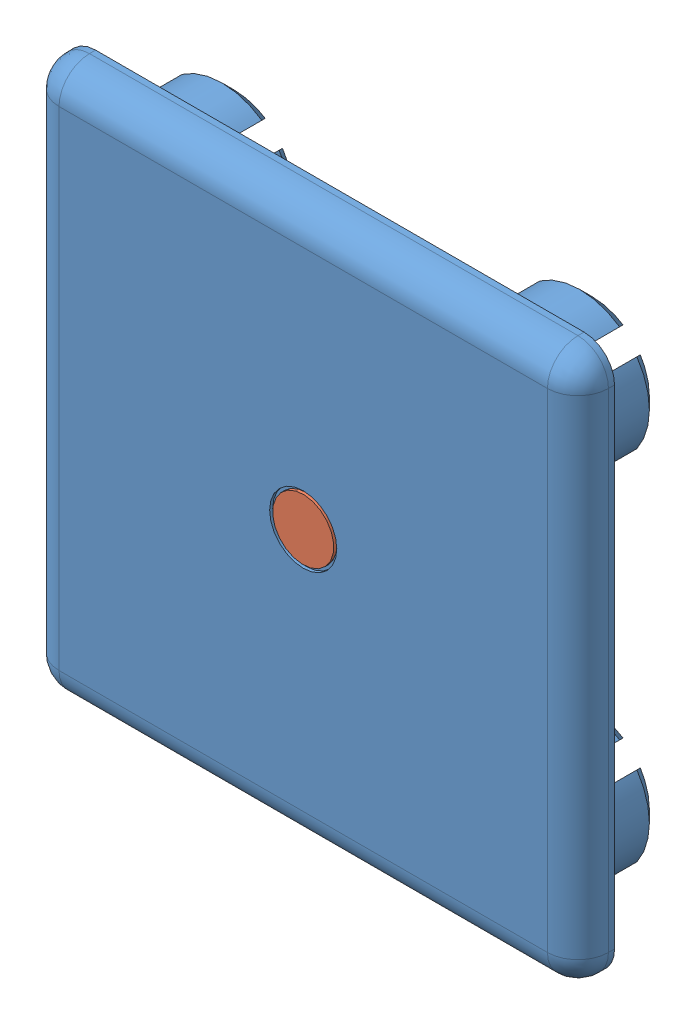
SolidWorks assembly 22.1004_1 END CAP 45X45 GRAY.SLDASM, configuration Default (file format 3800). Lengths in mm.
Overall size (45 45 11.9).
2 component instances, 2 part files, 2 mates.
Components (placement in the parent):
- 22.1004_1 END CAP 45X45 GRAY-1: 22.1004_1 END CAP 45X45 GRAY.SLDPRT [Default] at origin size (45 45 9)
- END CAP DOWEL GRAY-1: END CAP DOWEL GRAY.SLDPRT [Default] at (212.6048 130.3995 0) x (-0.923728 -0.383049 0) z (0 0 -1) size (5 5 11.9)
Mates (geometry in assembly coordinates):
- Coincident1: coincident: axis of ?; axis of 22.1004_1 END CAP 45X45 GRAY-1
- Coincident2: coincident aligned: plane of 22.1004_1 END CAP 45X45 GRAY-1 through (-26.2795 115.7229 13) normal (0 0 1); plane of ? through (-26.2795 115.7229 65.6261) normal (0 0 1)
